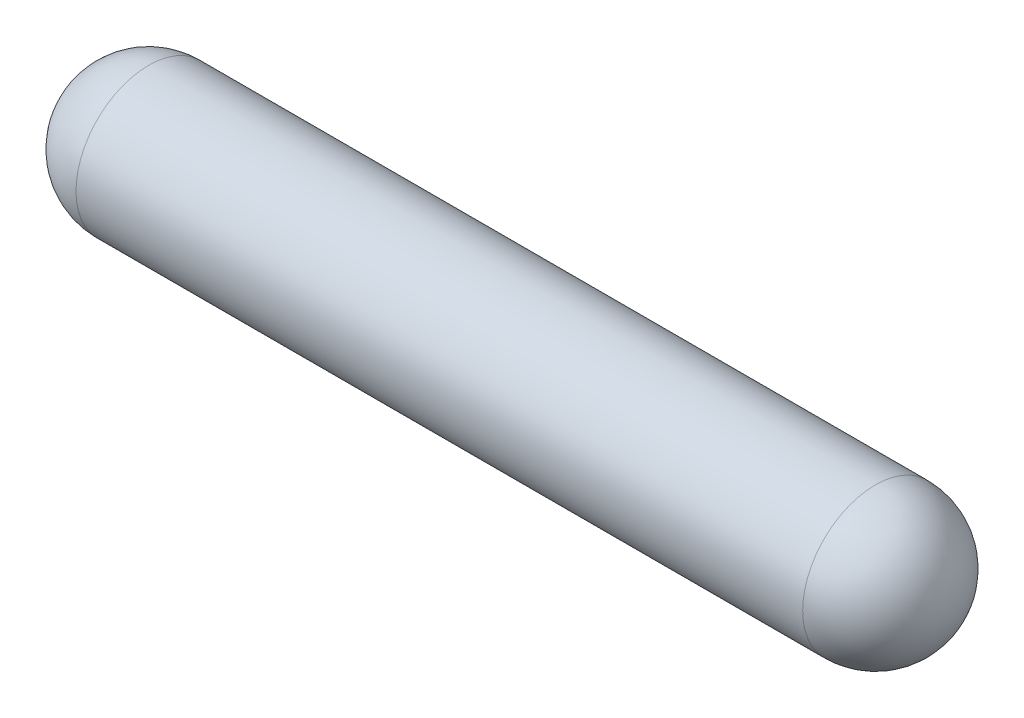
from build123d import *


with BuildPart() as part:
    # Sketch1 → Revolve1 (revolve)
    with BuildSketch(Plane.XY):
        with BuildLine():
            Line((-0.75, 0.75), (-8.25, 0.75))
            ThreePointArc((-8.25, 0.75), (-8.780330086, 0.530330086), (-9, 0))
            Line((-9, 0), (0, 0))
            ThreePointArc((0, 0), (-0.219669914, 0.530330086), (-0.75, 0.75))
        make_face()
    revolve(axis=Axis((0, 0, 0), (1, 0, 0)))


solid = part.part
